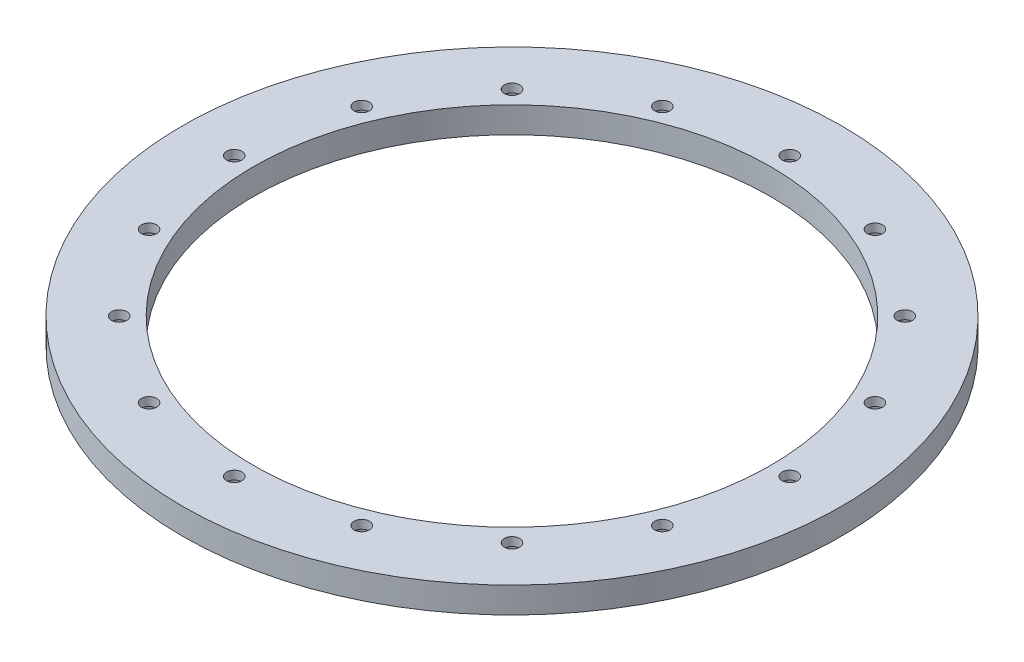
ISO-10303-21;
HEADER;
FILE_DESCRIPTION(('STEP AP214'),'2;1');
FILE_NAME('part.step','',(''),(''),'','','');
FILE_SCHEMA(('AUTOMOTIVE_DESIGN { 1 0 10303 214 1 1 1 1 }'));
ENDSEC;
DATA;
#1=APPLICATION_CONTEXT('core data for automotive mechanical design processes');
#2=APPLICATION_PROTOCOL_DEFINITION('international standard','automotive_design',2000,#1);
#3=PRODUCT_CONTEXT('',#1,'mechanical');
#4=PRODUCT('Part','Part','',(#3));
#5=PRODUCT_RELATED_PRODUCT_CATEGORY('part','',(#4));
#6=PRODUCT_DEFINITION_FORMATION('','',#4);
#7=PRODUCT_DEFINITION_CONTEXT('part definition',#1,'design');
#8=PRODUCT_DEFINITION('design','',#6,#7);
#9=PRODUCT_DEFINITION_SHAPE('','',#8);
#10=(LENGTH_UNIT() NAMED_UNIT(*) SI_UNIT(.MILLI.,.METRE.));
#11=(NAMED_UNIT(*) PLANE_ANGLE_UNIT() SI_UNIT($,.RADIAN.));
#12=(NAMED_UNIT(*) SI_UNIT($,.STERADIAN.) SOLID_ANGLE_UNIT());
#13=UNCERTAINTY_MEASURE_WITH_UNIT(LENGTH_MEASURE(1.E-05),#10,'distance_accuracy_value','');
#14=(GEOMETRIC_REPRESENTATION_CONTEXT(3) GLOBAL_UNCERTAINTY_ASSIGNED_CONTEXT((#13)) GLOBAL_UNIT_ASSIGNED_CONTEXT((#10,
#11,#12)) REPRESENTATION_CONTEXT('',''));
#15=CARTESIAN_POINT('',(0.,0.,0.));
#16=DIRECTION('',(0.,0.,1.));
#17=DIRECTION('',(1.,0.,0.));
#18=AXIS2_PLACEMENT_3D('',#15,#16,#17);
#19=CARTESIAN_POINT('',(0.,0.,0.));
#20=DIRECTION('',(0.,1.,0.));
#21=DIRECTION('',(0.,0.,1.));
#22=AXIS2_PLACEMENT_3D('',#19,#20,#21);
#23=PLANE('',#22);
#24=CARTESIAN_POINT('',(-94.2357123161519,0.,-39.0337101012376));
#25=DIRECTION('',(0.,-1.,0.));
#26=DIRECTION('',(0.,0.,-1.));
#27=AXIS2_PLACEMENT_3D('',#24,#25,#26);
#28=CIRCLE('',#27,4.96062);
#29=CARTESIAN_POINT('',(-94.2357123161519,0.,-43.9943301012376));
#30=VERTEX_POINT('',#29);
#31=EDGE_CURVE('E239',#30,#30,#28,.T.);
#32=ORIENTED_EDGE('',*,*,#31,.F.);
#33=EDGE_LOOP('',(#32));
#34=FACE_BOUND('',#33,.T.);
#35=CARTESIAN_POINT('',(-72.124891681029,0.,-72.1248916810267));
#36=DIRECTION('',(0.,-1.,0.));
#37=DIRECTION('',(0.,0.,-1.));
#38=AXIS2_PLACEMENT_3D('',#35,#36,#37);
#39=CIRCLE('',#38,4.96062);
#40=CARTESIAN_POINT('',(-72.124891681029,0.,-77.0855116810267));
#41=VERTEX_POINT('',#40);
#42=EDGE_CURVE('E227',#41,#41,#39,.T.);
#43=ORIENTED_EDGE('',*,*,#42,.F.);
#44=EDGE_LOOP('',(#43));
#45=FACE_BOUND('',#44,.T.);
#46=CARTESIAN_POINT('',(-1.424524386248E-12,0.,-102.));
#47=DIRECTION('',(0.,-1.,0.));
#48=DIRECTION('',(0.,0.,-1.));
#49=AXIS2_PLACEMENT_3D('',#46,#47,#48);
#50=CIRCLE('',#49,4.96062);
#51=CARTESIAN_POINT('',(-1.424524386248E-12,0.,-106.96062));
#52=VERTEX_POINT('',#51);
#53=EDGE_CURVE('E203',#52,#52,#50,.T.);
#54=ORIENTED_EDGE('',*,*,#53,.F.);
#55=EDGE_LOOP('',(#54));
#56=FACE_BOUND('',#55,.T.);
#57=CARTESIAN_POINT('',(39.0337101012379,0.,-94.2357123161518));
#58=DIRECTION('',(0.,-1.,0.));
#59=DIRECTION('',(0.,0.,-1.));
#60=AXIS2_PLACEMENT_3D('',#57,#58,#59);
#61=CIRCLE('',#60,4.96061999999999);
#62=CARTESIAN_POINT('',(39.0337101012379,0.,-99.1963323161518));
#63=VERTEX_POINT('',#62);
#64=EDGE_CURVE('E191',#63,#63,#61,.T.);
#65=ORIENTED_EDGE('',*,*,#64,.F.);
#66=EDGE_LOOP('',(#65));
#67=FACE_BOUND('',#66,.T.);
#68=CARTESIAN_POINT('',(72.124891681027,0.,-72.1248916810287));
#69=DIRECTION('',(0.,-1.,0.));
#70=DIRECTION('',(0.,0.,-1.));
#71=AXIS2_PLACEMENT_3D('',#68,#69,#70);
#72=CIRCLE('',#71,4.96062);
#73=CARTESIAN_POINT('',(72.124891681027,0.,-77.0855116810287));
#74=VERTEX_POINT('',#73);
#75=EDGE_CURVE('E179',#74,#74,#72,.T.);
#76=ORIENTED_EDGE('',*,*,#75,.F.);
#77=EDGE_LOOP('',(#76));
#78=FACE_BOUND('',#77,.T.);
#79=CARTESIAN_POINT('',(94.2357123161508,0.,-39.0337101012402));
#80=DIRECTION('',(0.,-1.,0.));
#81=DIRECTION('',(0.,0.,-1.));
#82=AXIS2_PLACEMENT_3D('',#79,#80,#81);
#83=CIRCLE('',#82,4.96062);
#84=CARTESIAN_POINT('',(94.2357123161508,0.,-43.9943301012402));
#85=VERTEX_POINT('',#84);
#86=EDGE_CURVE('E167',#85,#85,#83,.T.);
#87=ORIENTED_EDGE('',*,*,#86,.F.);
#88=EDGE_LOOP('',(#87));
#89=FACE_BOUND('',#88,.T.);
#90=CARTESIAN_POINT('',(94.2357123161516,0.,39.0337101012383));
#91=DIRECTION('',(0.,-1.,0.));
#92=DIRECTION('',(0.,0.,-1.));
#93=AXIS2_PLACEMENT_3D('',#90,#91,#92);
#94=CIRCLE('',#93,4.96062);
#95=CARTESIAN_POINT('',(94.2357123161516,0.,34.0730901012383));
#96=VERTEX_POINT('',#95);
#97=EDGE_CURVE('E143',#96,#96,#94,.T.);
#98=ORIENTED_EDGE('',*,*,#97,.F.);
#99=EDGE_LOOP('',(#98));
#100=FACE_BOUND('',#99,.T.);
#101=CARTESIAN_POINT('',(72.1248916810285,0.,72.1248916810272));
#102=DIRECTION('',(0.,-1.,0.));
#103=DIRECTION('',(0.,0.,-1.));
#104=AXIS2_PLACEMENT_3D('',#101,#102,#103);
#105=CIRCLE('',#104,4.96062);
#106=CARTESIAN_POINT('',(72.1248916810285,0.,67.1642716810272));
#107=VERTEX_POINT('',#106);
#108=EDGE_CURVE('E131',#107,#107,#105,.T.);
#109=ORIENTED_EDGE('',*,*,#108,.F.);
#110=EDGE_LOOP('',(#109));
#111=FACE_BOUND('',#110,.T.);
#112=CARTESIAN_POINT('',(39.0337101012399,0.,94.235712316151));
#113=DIRECTION('',(0.,-1.,0.));
#114=DIRECTION('',(0.,0.,-1.));
#115=AXIS2_PLACEMENT_3D('',#112,#113,#114);
#116=CIRCLE('',#115,4.96061999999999);
#117=CARTESIAN_POINT('',(39.0337101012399,0.,89.275092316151));
#118=VERTEX_POINT('',#117);
#119=EDGE_CURVE('E119',#118,#118,#116,.T.);
#120=ORIENTED_EDGE('',*,*,#119,.F.);
#121=EDGE_LOOP('',(#120));
#122=FACE_BOUND('',#121,.T.);
#123=CARTESIAN_POINT('',(7.12262193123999E-13,0.,102.));
#124=DIRECTION('',(0.,-1.,0.));
#125=DIRECTION('',(0.,0.,-1.));
#126=AXIS2_PLACEMENT_3D('',#123,#124,#125);
#127=CIRCLE('',#126,4.96062);
#128=CARTESIAN_POINT('',(7.12262193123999E-13,0.,97.03938));
#129=VERTEX_POINT('',#128);
#130=EDGE_CURVE('E107',#129,#129,#127,.T.);
#131=ORIENTED_EDGE('',*,*,#130,.F.);
#132=EDGE_LOOP('',(#131));
#133=FACE_BOUND('',#132,.T.);
#134=CARTESIAN_POINT('',(-39.0337101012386,0.,94.2357123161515));
#135=DIRECTION('',(0.,-1.,0.));
#136=DIRECTION('',(0.,0.,-1.));
#137=AXIS2_PLACEMENT_3D('',#134,#135,#136);
#138=CIRCLE('',#137,4.96061999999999);
#139=CARTESIAN_POINT('',(-39.0337101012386,0.,89.2750923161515));
#140=VERTEX_POINT('',#139);
#141=EDGE_CURVE('E95',#140,#140,#138,.T.);
#142=ORIENTED_EDGE('',*,*,#141,.F.);
#143=EDGE_LOOP('',(#142));
#144=FACE_BOUND('',#143,.T.);
#145=CARTESIAN_POINT('',(-72.1248916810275,0.,72.1248916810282));
#146=DIRECTION('',(0.,-1.,0.));
#147=DIRECTION('',(0.,0.,-1.));
#148=AXIS2_PLACEMENT_3D('',#145,#146,#147);
#149=CIRCLE('',#148,4.96062);
#150=CARTESIAN_POINT('',(-72.1248916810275,0.,67.1642716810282));
#151=VERTEX_POINT('',#150);
#152=EDGE_CURVE('E83',#151,#151,#149,.T.);
#153=ORIENTED_EDGE('',*,*,#152,.F.);
#154=EDGE_LOOP('',(#153));
#155=FACE_BOUND('',#154,.T.);
#156=CARTESIAN_POINT('',(-94.2357123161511,0.,39.0337101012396));
#157=DIRECTION('',(0.,-1.,0.));
#158=DIRECTION('',(0.,0.,-1.));
#159=AXIS2_PLACEMENT_3D('',#156,#157,#158);
#160=CIRCLE('',#159,4.96062);
#161=CARTESIAN_POINT('',(-94.2357123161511,0.,34.0730901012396));
#162=VERTEX_POINT('',#161);
#163=EDGE_CURVE('E71',#162,#162,#160,.T.);
#164=ORIENTED_EDGE('',*,*,#163,.F.);
#165=EDGE_LOOP('',(#164));
#166=FACE_BOUND('',#165,.T.);
#167=CARTESIAN_POINT('',(-102.,0.,3.56131096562E-13));
#168=DIRECTION('',(0.,-1.,0.));
#169=DIRECTION('',(0.,0.,-1.));
#170=AXIS2_PLACEMENT_3D('',#167,#168,#169);
#171=CIRCLE('',#170,4.96062);
#172=CARTESIAN_POINT('',(-102.,0.,-4.96061999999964));
#173=VERTEX_POINT('',#172);
#174=EDGE_CURVE('E59',#173,#173,#171,.T.);
#175=ORIENTED_EDGE('',*,*,#174,.F.);
#176=EDGE_LOOP('',(#175));
#177=FACE_BOUND('',#176,.T.);
#178=CARTESIAN_POINT('',(0.,0.,0.));
#179=DIRECTION('',(0.,1.,0.));
#180=DIRECTION('',(0.,0.,1.));
#181=AXIS2_PLACEMENT_3D('',#178,#179,#180);
#182=CIRCLE('',#181,121.016);
#183=CARTESIAN_POINT('',(0.,0.,-121.016));
#184=VERTEX_POINT('',#183);
#185=EDGE_CURVE('E36',#184,#184,#182,.T.);
#186=ORIENTED_EDGE('',*,*,#185,.F.);
#187=EDGE_LOOP('',(#186));
#188=FACE_BOUND('',#187,.T.);
#189=CARTESIAN_POINT('',(0.,0.,0.));
#190=DIRECTION('',(0.,1.,0.));
#191=DIRECTION('',(0.,0.,1.));
#192=AXIS2_PLACEMENT_3D('',#189,#190,#191);
#193=CIRCLE('',#192,95.);
#194=CARTESIAN_POINT('',(0.,0.,-95.));
#195=VERTEX_POINT('',#194);
#196=EDGE_CURVE('E45',#195,#195,#193,.T.);
#197=ORIENTED_EDGE('',*,*,#196,.T.);
#198=EDGE_LOOP('',(#197));
#199=FACE_BOUND('',#198,.T.);
#200=CARTESIAN_POINT('',(102.,0.,-3.56131096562E-13));
#201=DIRECTION('',(0.,-1.,0.));
#202=DIRECTION('',(0.,0.,-1.));
#203=AXIS2_PLACEMENT_3D('',#200,#201,#202);
#204=CIRCLE('',#203,4.96062);
#205=CARTESIAN_POINT('',(102.,0.,-4.96062000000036));
#206=VERTEX_POINT('',#205);
#207=EDGE_CURVE('E155',#206,#206,#204,.T.);
#208=ORIENTED_EDGE('',*,*,#207,.F.);
#209=EDGE_LOOP('',(#208));
#210=FACE_BOUND('',#209,.T.);
#211=CARTESIAN_POINT('',(-39.0337101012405,0.,-94.2357123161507));
#212=DIRECTION('',(0.,-1.,0.));
#213=DIRECTION('',(0.,0.,-1.));
#214=AXIS2_PLACEMENT_3D('',#211,#212,#213);
#215=CIRCLE('',#214,4.96061999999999);
#216=CARTESIAN_POINT('',(-39.0337101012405,0.,-99.1963323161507));
#217=VERTEX_POINT('',#216);
#218=EDGE_CURVE('E215',#217,#217,#215,.T.);
#219=ORIENTED_EDGE('',*,*,#218,.F.);
#220=EDGE_LOOP('',(#219));
#221=FACE_BOUND('',#220,.T.);
#222=ADVANCED_FACE('F32',(#34,#45,#56,#67,#78,#89,#100,#111,#122,#133,#144,#155,#166,#177,#188,
#199,#210,#221),#23,.F.);
#223=CARTESIAN_POINT('',(0.,9.525,0.));
#224=DIRECTION('',(0.,1.,0.));
#225=DIRECTION('',(0.,0.,1.));
#226=AXIS2_PLACEMENT_3D('',#223,#224,#225);
#227=PLANE('',#226);
#228=CARTESIAN_POINT('',(-94.2357123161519,9.525,-39.0337101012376));
#229=DIRECTION('',(0.,-1.,0.));
#230=DIRECTION('',(0.,0.,-1.));
#231=AXIS2_PLACEMENT_3D('',#228,#229,#230);
#232=CIRCLE('',#231,2.8067);
#233=CARTESIAN_POINT('',(-94.2357123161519,9.525,-41.8404101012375));
#234=VERTEX_POINT('',#233);
#235=EDGE_CURVE('E230',#234,#234,#232,.T.);
#236=ORIENTED_EDGE('',*,*,#235,.T.);
#237=EDGE_LOOP('',(#236));
#238=FACE_BOUND('',#237,.T.);
#239=CARTESIAN_POINT('',(-72.124891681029,9.525,-72.1248916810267));
#240=DIRECTION('',(0.,-1.,0.));
#241=DIRECTION('',(0.,0.,-1.));
#242=AXIS2_PLACEMENT_3D('',#239,#240,#241);
#243=CIRCLE('',#242,2.8067);
#244=CARTESIAN_POINT('',(-72.124891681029,9.525,-74.9315916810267));
#245=VERTEX_POINT('',#244);
#246=EDGE_CURVE('E218',#245,#245,#243,.T.);
#247=ORIENTED_EDGE('',*,*,#246,.T.);
#248=EDGE_LOOP('',(#247));
#249=FACE_BOUND('',#248,.T.);
#250=CARTESIAN_POINT('',(-39.0337101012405,9.525,-94.2357123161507));
#251=DIRECTION('',(0.,-1.,0.));
#252=DIRECTION('',(0.,0.,-1.));
#253=AXIS2_PLACEMENT_3D('',#250,#251,#252);
#254=CIRCLE('',#253,2.8067);
#255=CARTESIAN_POINT('',(-39.0337101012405,9.525,-97.0424123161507));
#256=VERTEX_POINT('',#255);
#257=EDGE_CURVE('E206',#256,#256,#254,.T.);
#258=ORIENTED_EDGE('',*,*,#257,.T.);
#259=EDGE_LOOP('',(#258));
#260=FACE_BOUND('',#259,.T.);
#261=CARTESIAN_POINT('',(-1.424524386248E-12,9.525,-102.));
#262=DIRECTION('',(0.,-1.,0.));
#263=DIRECTION('',(0.,0.,-1.));
#264=AXIS2_PLACEMENT_3D('',#261,#262,#263);
#265=CIRCLE('',#264,2.8067);
#266=CARTESIAN_POINT('',(-1.424524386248E-12,9.525,-104.8067));
#267=VERTEX_POINT('',#266);
#268=EDGE_CURVE('E194',#267,#267,#265,.T.);
#269=ORIENTED_EDGE('',*,*,#268,.T.);
#270=EDGE_LOOP('',(#269));
#271=FACE_BOUND('',#270,.T.);
#272=CARTESIAN_POINT('',(39.0337101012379,9.525,-94.2357123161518));
#273=DIRECTION('',(0.,-1.,0.));
#274=DIRECTION('',(0.,0.,-1.));
#275=AXIS2_PLACEMENT_3D('',#272,#273,#274);
#276=CIRCLE('',#275,2.8067);
#277=CARTESIAN_POINT('',(39.0337101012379,9.525,-97.0424123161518));
#278=VERTEX_POINT('',#277);
#279=EDGE_CURVE('E182',#278,#278,#276,.T.);
#280=ORIENTED_EDGE('',*,*,#279,.T.);
#281=EDGE_LOOP('',(#280));
#282=FACE_BOUND('',#281,.T.);
#283=CARTESIAN_POINT('',(72.124891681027,9.525,-72.1248916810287));
#284=DIRECTION('',(0.,-1.,0.));
#285=DIRECTION('',(0.,0.,-1.));
#286=AXIS2_PLACEMENT_3D('',#283,#284,#285);
#287=CIRCLE('',#286,2.8067);
#288=CARTESIAN_POINT('',(72.124891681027,9.525,-74.9315916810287));
#289=VERTEX_POINT('',#288);
#290=EDGE_CURVE('E170',#289,#289,#287,.T.);
#291=ORIENTED_EDGE('',*,*,#290,.T.);
#292=EDGE_LOOP('',(#291));
#293=FACE_BOUND('',#292,.T.);
#294=CARTESIAN_POINT('',(94.2357123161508,9.525,-39.0337101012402));
#295=DIRECTION('',(0.,-1.,0.));
#296=DIRECTION('',(0.,0.,-1.));
#297=AXIS2_PLACEMENT_3D('',#294,#295,#296);
#298=CIRCLE('',#297,2.8067);
#299=CARTESIAN_POINT('',(94.2357123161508,9.525,-41.8404101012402));
#300=VERTEX_POINT('',#299);
#301=EDGE_CURVE('E158',#300,#300,#298,.T.);
#302=ORIENTED_EDGE('',*,*,#301,.T.);
#303=EDGE_LOOP('',(#302));
#304=FACE_BOUND('',#303,.T.);
#305=CARTESIAN_POINT('',(0.,9.525,0.));
#306=DIRECTION('',(0.,1.,0.));
#307=DIRECTION('',(0.,0.,1.));
#308=AXIS2_PLACEMENT_3D('',#305,#306,#307);
#309=CIRCLE('',#308,95.);
#310=CARTESIAN_POINT('',(0.,9.525,-95.));
#311=VERTEX_POINT('',#310);
#312=EDGE_CURVE('E43',#311,#311,#309,.T.);
#313=ORIENTED_EDGE('',*,*,#312,.F.);
#314=EDGE_LOOP('',(#313));
#315=FACE_BOUND('',#314,.T.);
#316=CARTESIAN_POINT('',(0.,9.525,0.));
#317=DIRECTION('',(0.,1.,0.));
#318=DIRECTION('',(0.,0.,1.));
#319=AXIS2_PLACEMENT_3D('',#316,#317,#318);
#320=CIRCLE('',#319,121.016);
#321=CARTESIAN_POINT('',(0.,9.525,-121.016));
#322=VERTEX_POINT('',#321);
#323=EDGE_CURVE('E10',#322,#322,#320,.T.);
#324=ORIENTED_EDGE('',*,*,#323,.T.);
#325=EDGE_LOOP('',(#324));
#326=FACE_BOUND('',#325,.T.);
#327=CARTESIAN_POINT('',(-102.,9.525,3.56131096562E-13));
#328=DIRECTION('',(0.,-1.,0.));
#329=DIRECTION('',(0.,0.,-1.));
#330=AXIS2_PLACEMENT_3D('',#327,#328,#329);
#331=CIRCLE('',#330,2.8067);
#332=CARTESIAN_POINT('',(-102.,9.525,-2.80669999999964));
#333=VERTEX_POINT('',#332);
#334=EDGE_CURVE('E48',#333,#333,#331,.T.);
#335=ORIENTED_EDGE('',*,*,#334,.T.);
#336=EDGE_LOOP('',(#335));
#337=FACE_BOUND('',#336,.T.);
#338=CARTESIAN_POINT('',(-94.2357123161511,9.525,39.0337101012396));
#339=DIRECTION('',(0.,-1.,0.));
#340=DIRECTION('',(0.,0.,-1.));
#341=AXIS2_PLACEMENT_3D('',#338,#339,#340);
#342=CIRCLE('',#341,2.8067);
#343=CARTESIAN_POINT('',(-94.2357123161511,9.525,36.2270101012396));
#344=VERTEX_POINT('',#343);
#345=EDGE_CURVE('E62',#344,#344,#342,.T.);
#346=ORIENTED_EDGE('',*,*,#345,.T.);
#347=EDGE_LOOP('',(#346));
#348=FACE_BOUND('',#347,.T.);
#349=CARTESIAN_POINT('',(-72.1248916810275,9.525,72.1248916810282));
#350=DIRECTION('',(0.,-1.,0.));
#351=DIRECTION('',(0.,0.,-1.));
#352=AXIS2_PLACEMENT_3D('',#349,#350,#351);
#353=CIRCLE('',#352,2.8067);
#354=CARTESIAN_POINT('',(-72.1248916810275,9.525,69.3181916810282));
#355=VERTEX_POINT('',#354);
#356=EDGE_CURVE('E74',#355,#355,#353,.T.);
#357=ORIENTED_EDGE('',*,*,#356,.T.);
#358=EDGE_LOOP('',(#357));
#359=FACE_BOUND('',#358,.T.);
#360=CARTESIAN_POINT('',(-39.0337101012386,9.525,94.2357123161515));
#361=DIRECTION('',(0.,-1.,0.));
#362=DIRECTION('',(0.,0.,-1.));
#363=AXIS2_PLACEMENT_3D('',#360,#361,#362);
#364=CIRCLE('',#363,2.8067);
#365=CARTESIAN_POINT('',(-39.0337101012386,9.525,91.4290123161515));
#366=VERTEX_POINT('',#365);
#367=EDGE_CURVE('E86',#366,#366,#364,.T.);
#368=ORIENTED_EDGE('',*,*,#367,.T.);
#369=EDGE_LOOP('',(#368));
#370=FACE_BOUND('',#369,.T.);
#371=CARTESIAN_POINT('',(7.12262193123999E-13,9.525,102.));
#372=DIRECTION('',(0.,-1.,0.));
#373=DIRECTION('',(0.,0.,-1.));
#374=AXIS2_PLACEMENT_3D('',#371,#372,#373);
#375=CIRCLE('',#374,2.8067);
#376=CARTESIAN_POINT('',(7.12262193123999E-13,9.525,99.1933));
#377=VERTEX_POINT('',#376);
#378=EDGE_CURVE('E98',#377,#377,#375,.T.);
#379=ORIENTED_EDGE('',*,*,#378,.T.);
#380=EDGE_LOOP('',(#379));
#381=FACE_BOUND('',#380,.T.);
#382=CARTESIAN_POINT('',(39.0337101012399,9.525,94.235712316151));
#383=DIRECTION('',(0.,-1.,0.));
#384=DIRECTION('',(0.,0.,-1.));
#385=AXIS2_PLACEMENT_3D('',#382,#383,#384);
#386=CIRCLE('',#385,2.8067);
#387=CARTESIAN_POINT('',(39.0337101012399,9.525,91.429012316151));
#388=VERTEX_POINT('',#387);
#389=EDGE_CURVE('E110',#388,#388,#386,.T.);
#390=ORIENTED_EDGE('',*,*,#389,.T.);
#391=EDGE_LOOP('',(#390));
#392=FACE_BOUND('',#391,.T.);
#393=CARTESIAN_POINT('',(72.1248916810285,9.525,72.1248916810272));
#394=DIRECTION('',(0.,-1.,0.));
#395=DIRECTION('',(0.,0.,-1.));
#396=AXIS2_PLACEMENT_3D('',#393,#394,#395);
#397=CIRCLE('',#396,2.8067);
#398=CARTESIAN_POINT('',(72.1248916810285,9.525,69.3181916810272));
#399=VERTEX_POINT('',#398);
#400=EDGE_CURVE('E122',#399,#399,#397,.T.);
#401=ORIENTED_EDGE('',*,*,#400,.T.);
#402=EDGE_LOOP('',(#401));
#403=FACE_BOUND('',#402,.T.);
#404=CARTESIAN_POINT('',(94.2357123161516,9.525,39.0337101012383));
#405=DIRECTION('',(0.,-1.,0.));
#406=DIRECTION('',(0.,0.,-1.));
#407=AXIS2_PLACEMENT_3D('',#404,#405,#406);
#408=CIRCLE('',#407,2.8067);
#409=CARTESIAN_POINT('',(94.2357123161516,9.525,36.2270101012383));
#410=VERTEX_POINT('',#409);
#411=EDGE_CURVE('E134',#410,#410,#408,.T.);
#412=ORIENTED_EDGE('',*,*,#411,.T.);
#413=EDGE_LOOP('',(#412));
#414=FACE_BOUND('',#413,.T.);
#415=CARTESIAN_POINT('',(102.,9.525,-3.56131096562E-13));
#416=DIRECTION('',(0.,-1.,0.));
#417=DIRECTION('',(0.,0.,-1.));
#418=AXIS2_PLACEMENT_3D('',#415,#416,#417);
#419=CIRCLE('',#418,2.8067);
#420=CARTESIAN_POINT('',(102.,9.525,-2.80670000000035));
#421=VERTEX_POINT('',#420);
#422=EDGE_CURVE('E146',#421,#421,#419,.T.);
#423=ORIENTED_EDGE('',*,*,#422,.T.);
#424=EDGE_LOOP('',(#423));
#425=FACE_BOUND('',#424,.T.);
#426=ADVANCED_FACE('F247',(#238,#249,#260,#271,#282,#293,#304,#315,#326,#337,#348,#359,#370,
#381,#392,#403,#414,#425),#227,.T.);
#427=CARTESIAN_POINT('',(0.,9.525,0.));
#428=DIRECTION('',(0.,-1.,0.));
#429=DIRECTION('',(0.,0.,-1.));
#430=AXIS2_PLACEMENT_3D('',#427,#428,#429);
#431=CYLINDRICAL_SURFACE('',#430,121.016);
#432=CARTESIAN_POINT('',(0.,9.525,-121.016));
#433=CARTESIAN_POINT('',(0.,9.42578125,-121.016));
#434=CARTESIAN_POINT('',(0.,9.3265625,-121.016));
#435=CARTESIAN_POINT('',(0.,9.128125,-121.016));
#436=CARTESIAN_POINT('',(0.,9.02890625,-121.016));
#437=CARTESIAN_POINT('',(0.,8.83046875,-121.016));
#438=CARTESIAN_POINT('',(0.,8.73125,-121.016));
#439=CARTESIAN_POINT('',(0.,8.5328125,-121.016));
#440=CARTESIAN_POINT('',(0.,8.43359375,-121.016));
#441=CARTESIAN_POINT('',(0.,8.23515625,-121.016));
#442=CARTESIAN_POINT('',(0.,8.1359375,-121.016));
#443=CARTESIAN_POINT('',(0.,7.9375,-121.016));
#444=CARTESIAN_POINT('',(0.,7.83828125,-121.016));
#445=CARTESIAN_POINT('',(0.,7.63984375,-121.016));
#446=CARTESIAN_POINT('',(0.,7.540625,-121.016));
#447=CARTESIAN_POINT('',(0.,7.3421875,-121.016));
#448=CARTESIAN_POINT('',(0.,7.24296875,-121.016));
#449=CARTESIAN_POINT('',(0.,7.04453125,-121.016));
#450=CARTESIAN_POINT('',(0.,6.9453125,-121.016));
#451=CARTESIAN_POINT('',(0.,6.746875,-121.016));
#452=CARTESIAN_POINT('',(0.,6.64765625,-121.016));
#453=CARTESIAN_POINT('',(0.,6.44921875,-121.016));
#454=CARTESIAN_POINT('',(0.,6.35,-121.016));
#455=CARTESIAN_POINT('',(0.,6.1515625,-121.016));
#456=CARTESIAN_POINT('',(0.,6.05234375,-121.016));
#457=CARTESIAN_POINT('',(0.,5.85390625,-121.016));
#458=CARTESIAN_POINT('',(0.,5.7546875,-121.016));
#459=CARTESIAN_POINT('',(0.,5.55625,-121.016));
#460=CARTESIAN_POINT('',(0.,5.45703125,-121.016));
#461=CARTESIAN_POINT('',(0.,5.25859375,-121.016));
#462=CARTESIAN_POINT('',(0.,5.159375,-121.016));
#463=CARTESIAN_POINT('',(0.,4.9609375,-121.016));
#464=CARTESIAN_POINT('',(0.,4.86171875,-121.016));
#465=CARTESIAN_POINT('',(0.,4.66328125,-121.016));
#466=CARTESIAN_POINT('',(0.,4.5640625,-121.016));
#467=CARTESIAN_POINT('',(0.,4.365625,-121.016));
#468=CARTESIAN_POINT('',(0.,4.26640625,-121.016));
#469=CARTESIAN_POINT('',(0.,4.06796875,-121.016));
#470=CARTESIAN_POINT('',(0.,3.96875,-121.016));
#471=CARTESIAN_POINT('',(0.,3.7703125,-121.016));
#472=CARTESIAN_POINT('',(0.,3.67109375,-121.016));
#473=CARTESIAN_POINT('',(0.,3.47265625,-121.016));
#474=CARTESIAN_POINT('',(0.,3.3734375,-121.016));
#475=CARTESIAN_POINT('',(0.,3.175,-121.016));
#476=CARTESIAN_POINT('',(0.,3.07578125,-121.016));
#477=CARTESIAN_POINT('',(0.,2.87734375,-121.016));
#478=CARTESIAN_POINT('',(0.,2.778125,-121.016));
#479=CARTESIAN_POINT('',(0.,2.5796875,-121.016));
#480=CARTESIAN_POINT('',(0.,2.48046875,-121.016));
#481=CARTESIAN_POINT('',(0.,2.28203125,-121.016));
#482=CARTESIAN_POINT('',(0.,2.1828125,-121.016));
#483=CARTESIAN_POINT('',(0.,1.984375,-121.016));
#484=CARTESIAN_POINT('',(0.,1.88515625,-121.016));
#485=CARTESIAN_POINT('',(0.,1.68671875,-121.016));
#486=CARTESIAN_POINT('',(0.,1.5875,-121.016));
#487=CARTESIAN_POINT('',(0.,1.3890625,-121.016));
#488=CARTESIAN_POINT('',(0.,1.28984375,-121.016));
#489=CARTESIAN_POINT('',(0.,1.09140625,-121.016));
#490=CARTESIAN_POINT('',(0.,0.992187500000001,-121.016));
#491=CARTESIAN_POINT('',(0.,0.793750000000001,-121.016));
#492=CARTESIAN_POINT('',(0.,0.69453125,-121.016));
#493=CARTESIAN_POINT('',(0.,0.49609375,-121.016));
#494=CARTESIAN_POINT('',(0.,0.396875,-121.016));
#495=CARTESIAN_POINT('',(0.,0.1984375,-121.016));
#496=CARTESIAN_POINT('',(0.,0.0992187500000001,-121.016));
#497=CARTESIAN_POINT('',(0.,0.,-121.016));
#498=B_SPLINE_CURVE_WITH_KNOTS('',3,(#432,#433,#434,#435,#436,#437,#438,#439,#440,#441,#442,
#443,#444,#445,#446,#447,#448,#449,#450,#451,#452,#453,#454,#455,#456,#457,#458,#459,#460,#461,
#462,#463,#464,#465,#466,#467,#468,#469,#470,#471,#472,#473,#474,#475,#476,#477,#478,#479,#480,
#481,#482,#483,#484,#485,#486,#487,#488,#489,#490,#491,#492,#493,#494,#495,#496,#497),
.UNSPECIFIED.,.F.,.F.,(4,2,2,2,2,2,2,2,2,2,2,2,2,2,2,2,2,2,2,2,2,2,2,2,2,2,2,2,2,2,2,2,4),(0.,
0.297656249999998,0.595312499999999,0.892968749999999,1.190625,1.48828125,1.7859375,2.08359375,
2.38125,2.67890625,2.9765625,3.27421875,3.571875,3.86953125,4.1671875,4.46484375,4.7625,
5.06015625,5.3578125,5.65546875,5.953125,6.25078125,6.5484375,6.84609375,7.14375,7.44140625,
7.7390625,8.03671875,8.334375,8.63203125,8.9296875,9.22734375,9.525),.UNSPECIFIED.);
#499=EDGE_CURVE('BSEAM34',#322,#184,#498,.T.);
#500=ORIENTED_EDGE('',*,*,#323,.F.);
#501=ORIENTED_EDGE('',*,*,#185,.T.);
#502=ORIENTED_EDGE('',*,*,#499,.T.);
#503=ORIENTED_EDGE('',*,*,#499,.F.);
#504=EDGE_LOOP('',(#500,#502,#501,#503));
#505=FACE_BOUND('',#504,.T.);
#506=ADVANCED_FACE('F34',(#505),#431,.T.);
#507=CARTESIAN_POINT('',(0.,9.525,0.));
#508=DIRECTION('',(0.,-1.,0.));
#509=DIRECTION('',(0.,0.,-1.));
#510=AXIS2_PLACEMENT_3D('',#507,#508,#509);
#511=CYLINDRICAL_SURFACE('',#510,95.);
#512=CARTESIAN_POINT('',(0.,9.525,-95.));
#513=CARTESIAN_POINT('',(0.,9.42578125,-95.));
#514=CARTESIAN_POINT('',(0.,9.3265625,-95.));
#515=CARTESIAN_POINT('',(0.,9.128125,-95.));
#516=CARTESIAN_POINT('',(0.,9.02890625,-95.));
#517=CARTESIAN_POINT('',(0.,8.83046875,-95.));
#518=CARTESIAN_POINT('',(0.,8.73125,-95.));
#519=CARTESIAN_POINT('',(0.,8.5328125,-95.));
#520=CARTESIAN_POINT('',(0.,8.43359375,-95.));
#521=CARTESIAN_POINT('',(0.,8.23515625,-95.));
#522=CARTESIAN_POINT('',(0.,8.1359375,-95.));
#523=CARTESIAN_POINT('',(0.,7.9375,-95.));
#524=CARTESIAN_POINT('',(0.,7.83828125,-95.));
#525=CARTESIAN_POINT('',(0.,7.63984375,-95.));
#526=CARTESIAN_POINT('',(0.,7.540625,-95.));
#527=CARTESIAN_POINT('',(0.,7.3421875,-95.));
#528=CARTESIAN_POINT('',(0.,7.24296875,-95.));
#529=CARTESIAN_POINT('',(0.,7.04453125,-95.));
#530=CARTESIAN_POINT('',(0.,6.9453125,-95.));
#531=CARTESIAN_POINT('',(0.,6.746875,-95.));
#532=CARTESIAN_POINT('',(0.,6.64765625,-95.));
#533=CARTESIAN_POINT('',(0.,6.44921875,-95.));
#534=CARTESIAN_POINT('',(0.,6.35,-95.));
#535=CARTESIAN_POINT('',(0.,6.1515625,-95.));
#536=CARTESIAN_POINT('',(0.,6.05234375,-95.));
#537=CARTESIAN_POINT('',(0.,5.85390625,-95.));
#538=CARTESIAN_POINT('',(0.,5.7546875,-95.));
#539=CARTESIAN_POINT('',(0.,5.55625,-95.));
#540=CARTESIAN_POINT('',(0.,5.45703125,-95.));
#541=CARTESIAN_POINT('',(0.,5.25859375,-95.));
#542=CARTESIAN_POINT('',(0.,5.159375,-95.));
#543=CARTESIAN_POINT('',(0.,4.9609375,-95.));
#544=CARTESIAN_POINT('',(0.,4.86171875,-95.));
#545=CARTESIAN_POINT('',(0.,4.66328125,-95.));
#546=CARTESIAN_POINT('',(0.,4.5640625,-95.));
#547=CARTESIAN_POINT('',(0.,4.365625,-95.));
#548=CARTESIAN_POINT('',(0.,4.26640625,-95.));
#549=CARTESIAN_POINT('',(0.,4.06796875,-95.));
#550=CARTESIAN_POINT('',(0.,3.96875,-95.));
#551=CARTESIAN_POINT('',(0.,3.7703125,-95.));
#552=CARTESIAN_POINT('',(0.,3.67109375,-95.));
#553=CARTESIAN_POINT('',(0.,3.47265625,-95.));
#554=CARTESIAN_POINT('',(0.,3.3734375,-95.));
#555=CARTESIAN_POINT('',(0.,3.175,-95.));
#556=CARTESIAN_POINT('',(0.,3.07578125,-95.));
#557=CARTESIAN_POINT('',(0.,2.87734375,-95.));
#558=CARTESIAN_POINT('',(0.,2.778125,-95.));
#559=CARTESIAN_POINT('',(0.,2.5796875,-95.));
#560=CARTESIAN_POINT('',(0.,2.48046875,-95.));
#561=CARTESIAN_POINT('',(0.,2.28203125,-95.));
#562=CARTESIAN_POINT('',(0.,2.1828125,-95.));
#563=CARTESIAN_POINT('',(0.,1.984375,-95.));
#564=CARTESIAN_POINT('',(0.,1.88515625,-95.));
#565=CARTESIAN_POINT('',(0.,1.68671875,-95.));
#566=CARTESIAN_POINT('',(0.,1.5875,-95.));
#567=CARTESIAN_POINT('',(0.,1.3890625,-95.));
#568=CARTESIAN_POINT('',(0.,1.28984375,-95.));
#569=CARTESIAN_POINT('',(0.,1.09140625,-95.));
#570=CARTESIAN_POINT('',(0.,0.992187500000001,-95.));
#571=CARTESIAN_POINT('',(0.,0.793750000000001,-95.));
#572=CARTESIAN_POINT('',(0.,0.69453125,-95.));
#573=CARTESIAN_POINT('',(0.,0.49609375,-95.));
#574=CARTESIAN_POINT('',(0.,0.396875,-95.));
#575=CARTESIAN_POINT('',(0.,0.1984375,-95.));
#576=CARTESIAN_POINT('',(0.,0.0992187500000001,-95.));
#577=CARTESIAN_POINT('',(0.,0.,-95.));
#578=B_SPLINE_CURVE_WITH_KNOTS('',3,(#512,#513,#514,#515,#516,#517,#518,#519,#520,#521,#522,
#523,#524,#525,#526,#527,#528,#529,#530,#531,#532,#533,#534,#535,#536,#537,#538,#539,#540,#541,
#542,#543,#544,#545,#546,#547,#548,#549,#550,#551,#552,#553,#554,#555,#556,#557,#558,#559,#560,
#561,#562,#563,#564,#565,#566,#567,#568,#569,#570,#571,#572,#573,#574,#575,#576,#577),
.UNSPECIFIED.,.F.,.F.,(4,2,2,2,2,2,2,2,2,2,2,2,2,2,2,2,2,2,2,2,2,2,2,2,2,2,2,2,2,2,2,2,4),(0.,
0.297656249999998,0.595312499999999,0.892968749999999,1.190625,1.48828125,1.7859375,2.08359375,
2.38125,2.67890625,2.9765625,3.27421875,3.571875,3.86953125,4.1671875,4.46484375,4.7625,
5.06015625,5.3578125,5.65546875,5.953125,6.25078125,6.5484375,6.84609375,7.14375,7.44140625,
7.7390625,8.03671875,8.334375,8.63203125,8.9296875,9.22734375,9.525),.UNSPECIFIED.);
#579=EDGE_CURVE('BSEAM459',#311,#195,#578,.T.);
#580=ORIENTED_EDGE('',*,*,#312,.T.);
#581=ORIENTED_EDGE('',*,*,#196,.F.);
#582=ORIENTED_EDGE('',*,*,#579,.T.);
#583=ORIENTED_EDGE('',*,*,#579,.F.);
#584=EDGE_LOOP('',(#580,#582,#581,#583));
#585=FACE_BOUND('',#584,.T.);
#586=ADVANCED_FACE('F459',(#585),#511,.F.);
#587=CARTESIAN_POINT('',(-102.,0.,3.56131096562E-13));
#588=DIRECTION('',(0.,-1.,0.));
#589=DIRECTION('',(0.,0.,-1.));
#590=AXIS2_PLACEMENT_3D('',#587,#588,#589);
#591=CYLINDRICAL_SURFACE('',#590,2.8067);
#592=ORIENTED_EDGE('',*,*,#334,.F.);
#593=EDGE_LOOP('',(#592));
#594=FACE_BOUND('',#593,.T.);
#595=CARTESIAN_POINT('',(-102.,6.3754,3.56131096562E-13));
#596=DIRECTION('',(0.,-1.,0.));
#597=DIRECTION('',(0.,0.,-1.));
#598=AXIS2_PLACEMENT_3D('',#595,#596,#597);
#599=CIRCLE('',#598,2.8067);
#600=CARTESIAN_POINT('',(-102.,6.3754,-2.80669999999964));
#601=VERTEX_POINT('',#600);
#602=EDGE_CURVE('E53',#601,#601,#599,.T.);
#603=ORIENTED_EDGE('',*,*,#602,.T.);
#604=EDGE_LOOP('',(#603));
#605=FACE_BOUND('',#604,.T.);
#606=ADVANCED_FACE('F455',(#594,#605),#591,.F.);
#607=CARTESIAN_POINT('',(-99.1933,6.3754,3.56131096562E-13));
#608=DIRECTION('',(0.,1.,0.));
#609=DIRECTION('',(0.,0.,1.));
#610=AXIS2_PLACEMENT_3D('',#607,#608,#609);
#611=PLANE('',#610);
#612=ORIENTED_EDGE('',*,*,#602,.F.);
#613=EDGE_LOOP('',(#612));
#614=FACE_BOUND('',#613,.T.);
#615=CARTESIAN_POINT('',(-102.,6.3754,3.56131096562E-13));
#616=DIRECTION('',(0.,-1.,0.));
#617=DIRECTION('',(0.,0.,-1.));
#618=AXIS2_PLACEMENT_3D('',#615,#616,#617);
#619=CIRCLE('',#618,4.96062);
#620=CARTESIAN_POINT('',(-102.,6.3754,-4.96061999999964));
#621=VERTEX_POINT('',#620);
#622=EDGE_CURVE('E56',#621,#621,#619,.T.);
#623=ORIENTED_EDGE('',*,*,#622,.T.);
#624=EDGE_LOOP('',(#623));
#625=FACE_BOUND('',#624,.T.);
#626=ADVANCED_FACE('F451',(#614,#625),#611,.F.);
#627=CARTESIAN_POINT('',(-102.,0.,3.56131096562E-13));
#628=DIRECTION('',(0.,-1.,0.));
#629=DIRECTION('',(0.,0.,-1.));
#630=AXIS2_PLACEMENT_3D('',#627,#628,#629);
#631=CYLINDRICAL_SURFACE('',#630,4.96062);
#632=ORIENTED_EDGE('',*,*,#622,.F.);
#633=EDGE_LOOP('',(#632));
#634=FACE_BOUND('',#633,.T.);
#635=ORIENTED_EDGE('',*,*,#174,.T.);
#636=EDGE_LOOP('',(#635));
#637=FACE_BOUND('',#636,.T.);
#638=ADVANCED_FACE('F447',(#634,#637),#631,.F.);
#639=CARTESIAN_POINT('',(-94.2357123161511,0.,39.0337101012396));
#640=DIRECTION('',(0.,-1.,0.));
#641=DIRECTION('',(0.,0.,-1.));
#642=AXIS2_PLACEMENT_3D('',#639,#640,#641);
#643=CYLINDRICAL_SURFACE('',#642,2.8067);
#644=ORIENTED_EDGE('',*,*,#345,.F.);
#645=EDGE_LOOP('',(#644));
#646=FACE_BOUND('',#645,.T.);
#647=CARTESIAN_POINT('',(-94.2357123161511,6.3754,39.0337101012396));
#648=DIRECTION('',(0.,-1.,0.));
#649=DIRECTION('',(0.,0.,-1.));
#650=AXIS2_PLACEMENT_3D('',#647,#648,#649);
#651=CIRCLE('',#650,2.8067);
#652=CARTESIAN_POINT('',(-94.2357123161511,6.3754,36.2270101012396));
#653=VERTEX_POINT('',#652);
#654=EDGE_CURVE('E65',#653,#653,#651,.T.);
#655=ORIENTED_EDGE('',*,*,#654,.T.);
#656=EDGE_LOOP('',(#655));
#657=FACE_BOUND('',#656,.T.);
#658=ADVANCED_FACE('F443',(#646,#657),#643,.F.);
#659=CARTESIAN_POINT('',(-91.4290123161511,6.3754,39.0337101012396));
#660=DIRECTION('',(0.,1.,0.));
#661=DIRECTION('',(0.,0.,1.));
#662=AXIS2_PLACEMENT_3D('',#659,#660,#661);
#663=PLANE('',#662);
#664=ORIENTED_EDGE('',*,*,#654,.F.);
#665=EDGE_LOOP('',(#664));
#666=FACE_BOUND('',#665,.T.);
#667=CARTESIAN_POINT('',(-94.2357123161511,6.3754,39.0337101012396));
#668=DIRECTION('',(0.,-1.,0.));
#669=DIRECTION('',(0.,0.,-1.));
#670=AXIS2_PLACEMENT_3D('',#667,#668,#669);
#671=CIRCLE('',#670,4.96062);
#672=CARTESIAN_POINT('',(-94.2357123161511,6.3754,34.0730901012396));
#673=VERTEX_POINT('',#672);
#674=EDGE_CURVE('E68',#673,#673,#671,.T.);
#675=ORIENTED_EDGE('',*,*,#674,.T.);
#676=EDGE_LOOP('',(#675));
#677=FACE_BOUND('',#676,.T.);
#678=ADVANCED_FACE('F439',(#666,#677),#663,.F.);
#679=CARTESIAN_POINT('',(-94.2357123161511,0.,39.0337101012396));
#680=DIRECTION('',(0.,-1.,0.));
#681=DIRECTION('',(0.,0.,-1.));
#682=AXIS2_PLACEMENT_3D('',#679,#680,#681);
#683=CYLINDRICAL_SURFACE('',#682,4.96062);
#684=ORIENTED_EDGE('',*,*,#674,.F.);
#685=EDGE_LOOP('',(#684));
#686=FACE_BOUND('',#685,.T.);
#687=ORIENTED_EDGE('',*,*,#163,.T.);
#688=EDGE_LOOP('',(#687));
#689=FACE_BOUND('',#688,.T.);
#690=ADVANCED_FACE('F435',(#686,#689),#683,.F.);
#691=CARTESIAN_POINT('',(-72.1248916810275,0.,72.1248916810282));
#692=DIRECTION('',(0.,-1.,0.));
#693=DIRECTION('',(0.,0.,-1.));
#694=AXIS2_PLACEMENT_3D('',#691,#692,#693);
#695=CYLINDRICAL_SURFACE('',#694,2.8067);
#696=ORIENTED_EDGE('',*,*,#356,.F.);
#697=EDGE_LOOP('',(#696));
#698=FACE_BOUND('',#697,.T.);
#699=CARTESIAN_POINT('',(-72.1248916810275,6.3754,72.1248916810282));
#700=DIRECTION('',(0.,-1.,0.));
#701=DIRECTION('',(0.,0.,-1.));
#702=AXIS2_PLACEMENT_3D('',#699,#700,#701);
#703=CIRCLE('',#702,2.8067);
#704=CARTESIAN_POINT('',(-72.1248916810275,6.3754,69.3181916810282));
#705=VERTEX_POINT('',#704);
#706=EDGE_CURVE('E77',#705,#705,#703,.T.);
#707=ORIENTED_EDGE('',*,*,#706,.T.);
#708=EDGE_LOOP('',(#707));
#709=FACE_BOUND('',#708,.T.);
#710=ADVANCED_FACE('F431',(#698,#709),#695,.F.);
#711=CARTESIAN_POINT('',(-69.3181916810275,6.3754,72.1248916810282));
#712=DIRECTION('',(0.,1.,0.));
#713=DIRECTION('',(0.,0.,1.));
#714=AXIS2_PLACEMENT_3D('',#711,#712,#713);
#715=PLANE('',#714);
#716=ORIENTED_EDGE('',*,*,#706,.F.);
#717=EDGE_LOOP('',(#716));
#718=FACE_BOUND('',#717,.T.);
#719=CARTESIAN_POINT('',(-72.1248916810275,6.3754,72.1248916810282));
#720=DIRECTION('',(0.,-1.,0.));
#721=DIRECTION('',(0.,0.,-1.));
#722=AXIS2_PLACEMENT_3D('',#719,#720,#721);
#723=CIRCLE('',#722,4.96062);
#724=CARTESIAN_POINT('',(-72.1248916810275,6.3754,67.1642716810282));
#725=VERTEX_POINT('',#724);
#726=EDGE_CURVE('E80',#725,#725,#723,.T.);
#727=ORIENTED_EDGE('',*,*,#726,.T.);
#728=EDGE_LOOP('',(#727));
#729=FACE_BOUND('',#728,.T.);
#730=ADVANCED_FACE('F427',(#718,#729),#715,.F.);
#731=CARTESIAN_POINT('',(-72.1248916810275,0.,72.1248916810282));
#732=DIRECTION('',(0.,-1.,0.));
#733=DIRECTION('',(0.,0.,-1.));
#734=AXIS2_PLACEMENT_3D('',#731,#732,#733);
#735=CYLINDRICAL_SURFACE('',#734,4.96062);
#736=ORIENTED_EDGE('',*,*,#726,.F.);
#737=EDGE_LOOP('',(#736));
#738=FACE_BOUND('',#737,.T.);
#739=ORIENTED_EDGE('',*,*,#152,.T.);
#740=EDGE_LOOP('',(#739));
#741=FACE_BOUND('',#740,.T.);
#742=ADVANCED_FACE('F423',(#738,#741),#735,.F.);
#743=CARTESIAN_POINT('',(-39.0337101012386,0.,94.2357123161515));
#744=DIRECTION('',(0.,-1.,0.));
#745=DIRECTION('',(0.,0.,-1.));
#746=AXIS2_PLACEMENT_3D('',#743,#744,#745);
#747=CYLINDRICAL_SURFACE('',#746,2.8067);
#748=ORIENTED_EDGE('',*,*,#367,.F.);
#749=EDGE_LOOP('',(#748));
#750=FACE_BOUND('',#749,.T.);
#751=CARTESIAN_POINT('',(-39.0337101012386,6.3754,94.2357123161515));
#752=DIRECTION('',(0.,-1.,0.));
#753=DIRECTION('',(0.,0.,-1.));
#754=AXIS2_PLACEMENT_3D('',#751,#752,#753);
#755=CIRCLE('',#754,2.8067);
#756=CARTESIAN_POINT('',(-39.0337101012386,6.3754,91.4290123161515));
#757=VERTEX_POINT('',#756);
#758=EDGE_CURVE('E89',#757,#757,#755,.T.);
#759=ORIENTED_EDGE('',*,*,#758,.T.);
#760=EDGE_LOOP('',(#759));
#761=FACE_BOUND('',#760,.T.);
#762=ADVANCED_FACE('F419',(#750,#761),#747,.F.);
#763=CARTESIAN_POINT('',(-36.2270101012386,6.3754,94.2357123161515));
#764=DIRECTION('',(0.,1.,0.));
#765=DIRECTION('',(0.,0.,1.));
#766=AXIS2_PLACEMENT_3D('',#763,#764,#765);
#767=PLANE('',#766);
#768=ORIENTED_EDGE('',*,*,#758,.F.);
#769=EDGE_LOOP('',(#768));
#770=FACE_BOUND('',#769,.T.);
#771=CARTESIAN_POINT('',(-39.0337101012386,6.3754,94.2357123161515));
#772=DIRECTION('',(0.,-1.,0.));
#773=DIRECTION('',(0.,0.,-1.));
#774=AXIS2_PLACEMENT_3D('',#771,#772,#773);
#775=CIRCLE('',#774,4.96062);
#776=CARTESIAN_POINT('',(-39.0337101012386,6.3754,89.2750923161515));
#777=VERTEX_POINT('',#776);
#778=EDGE_CURVE('E92',#777,#777,#775,.T.);
#779=ORIENTED_EDGE('',*,*,#778,.T.);
#780=EDGE_LOOP('',(#779));
#781=FACE_BOUND('',#780,.T.);
#782=ADVANCED_FACE('F415',(#770,#781),#767,.F.);
#783=CARTESIAN_POINT('',(-39.0337101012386,0.,94.2357123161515));
#784=DIRECTION('',(0.,-1.,0.));
#785=DIRECTION('',(0.,0.,-1.));
#786=AXIS2_PLACEMENT_3D('',#783,#784,#785);
#787=CYLINDRICAL_SURFACE('',#786,4.96062);
#788=ORIENTED_EDGE('',*,*,#778,.F.);
#789=EDGE_LOOP('',(#788));
#790=FACE_BOUND('',#789,.T.);
#791=ORIENTED_EDGE('',*,*,#141,.T.);
#792=EDGE_LOOP('',(#791));
#793=FACE_BOUND('',#792,.T.);
#794=ADVANCED_FACE('F411',(#790,#793),#787,.F.);
#795=CARTESIAN_POINT('',(7.12262193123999E-13,0.,102.));
#796=DIRECTION('',(0.,-1.,0.));
#797=DIRECTION('',(0.,0.,-1.));
#798=AXIS2_PLACEMENT_3D('',#795,#796,#797);
#799=CYLINDRICAL_SURFACE('',#798,2.8067);
#800=ORIENTED_EDGE('',*,*,#378,.F.);
#801=EDGE_LOOP('',(#800));
#802=FACE_BOUND('',#801,.T.);
#803=CARTESIAN_POINT('',(7.12262193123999E-13,6.3754,102.));
#804=DIRECTION('',(0.,-1.,0.));
#805=DIRECTION('',(0.,0.,-1.));
#806=AXIS2_PLACEMENT_3D('',#803,#804,#805);
#807=CIRCLE('',#806,2.8067);
#808=CARTESIAN_POINT('',(7.12262193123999E-13,6.3754,99.1933));
#809=VERTEX_POINT('',#808);
#810=EDGE_CURVE('E101',#809,#809,#807,.T.);
#811=ORIENTED_EDGE('',*,*,#810,.T.);
#812=EDGE_LOOP('',(#811));
#813=FACE_BOUND('',#812,.T.);
#814=ADVANCED_FACE('F407',(#802,#813),#799,.F.);
#815=CARTESIAN_POINT('',(2.80670000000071,6.3754,102.));
#816=DIRECTION('',(0.,1.,0.));
#817=DIRECTION('',(0.,0.,1.));
#818=AXIS2_PLACEMENT_3D('',#815,#816,#817);
#819=PLANE('',#818);
#820=ORIENTED_EDGE('',*,*,#810,.F.);
#821=EDGE_LOOP('',(#820));
#822=FACE_BOUND('',#821,.T.);
#823=CARTESIAN_POINT('',(7.12262193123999E-13,6.3754,102.));
#824=DIRECTION('',(0.,-1.,0.));
#825=DIRECTION('',(0.,0.,-1.));
#826=AXIS2_PLACEMENT_3D('',#823,#824,#825);
#827=CIRCLE('',#826,4.96062);
#828=CARTESIAN_POINT('',(7.12262193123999E-13,6.3754,97.03938));
#829=VERTEX_POINT('',#828);
#830=EDGE_CURVE('E104',#829,#829,#827,.T.);
#831=ORIENTED_EDGE('',*,*,#830,.T.);
#832=EDGE_LOOP('',(#831));
#833=FACE_BOUND('',#832,.T.);
#834=ADVANCED_FACE('F403',(#822,#833),#819,.F.);
#835=CARTESIAN_POINT('',(7.12262193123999E-13,0.,102.));
#836=DIRECTION('',(0.,-1.,0.));
#837=DIRECTION('',(0.,0.,-1.));
#838=AXIS2_PLACEMENT_3D('',#835,#836,#837);
#839=CYLINDRICAL_SURFACE('',#838,4.96062);
#840=ORIENTED_EDGE('',*,*,#830,.F.);
#841=EDGE_LOOP('',(#840));
#842=FACE_BOUND('',#841,.T.);
#843=ORIENTED_EDGE('',*,*,#130,.T.);
#844=EDGE_LOOP('',(#843));
#845=FACE_BOUND('',#844,.T.);
#846=ADVANCED_FACE('F399',(#842,#845),#839,.F.);
#847=CARTESIAN_POINT('',(39.0337101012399,0.,94.235712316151));
#848=DIRECTION('',(0.,-1.,0.));
#849=DIRECTION('',(0.,0.,-1.));
#850=AXIS2_PLACEMENT_3D('',#847,#848,#849);
#851=CYLINDRICAL_SURFACE('',#850,2.8067);
#852=ORIENTED_EDGE('',*,*,#389,.F.);
#853=EDGE_LOOP('',(#852));
#854=FACE_BOUND('',#853,.T.);
#855=CARTESIAN_POINT('',(39.0337101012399,6.3754,94.235712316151));
#856=DIRECTION('',(0.,-1.,0.));
#857=DIRECTION('',(0.,0.,-1.));
#858=AXIS2_PLACEMENT_3D('',#855,#856,#857);
#859=CIRCLE('',#858,2.8067);
#860=CARTESIAN_POINT('',(39.0337101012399,6.3754,91.4290123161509));
#861=VERTEX_POINT('',#860);
#862=EDGE_CURVE('E113',#861,#861,#859,.T.);
#863=ORIENTED_EDGE('',*,*,#862,.T.);
#864=EDGE_LOOP('',(#863));
#865=FACE_BOUND('',#864,.T.);
#866=ADVANCED_FACE('F395',(#854,#865),#851,.F.);
#867=CARTESIAN_POINT('',(41.8404101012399,6.3754,94.235712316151));
#868=DIRECTION('',(0.,1.,0.));
#869=DIRECTION('',(0.,0.,1.));
#870=AXIS2_PLACEMENT_3D('',#867,#868,#869);
#871=PLANE('',#870);
#872=ORIENTED_EDGE('',*,*,#862,.F.);
#873=EDGE_LOOP('',(#872));
#874=FACE_BOUND('',#873,.T.);
#875=CARTESIAN_POINT('',(39.0337101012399,6.3754,94.235712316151));
#876=DIRECTION('',(0.,-1.,0.));
#877=DIRECTION('',(0.,0.,-1.));
#878=AXIS2_PLACEMENT_3D('',#875,#876,#877);
#879=CIRCLE('',#878,4.96062);
#880=CARTESIAN_POINT('',(39.0337101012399,6.3754,89.2750923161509));
#881=VERTEX_POINT('',#880);
#882=EDGE_CURVE('E116',#881,#881,#879,.T.);
#883=ORIENTED_EDGE('',*,*,#882,.T.);
#884=EDGE_LOOP('',(#883));
#885=FACE_BOUND('',#884,.T.);
#886=ADVANCED_FACE('F391',(#874,#885),#871,.F.);
#887=CARTESIAN_POINT('',(39.0337101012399,0.,94.235712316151));
#888=DIRECTION('',(0.,-1.,0.));
#889=DIRECTION('',(0.,0.,-1.));
#890=AXIS2_PLACEMENT_3D('',#887,#888,#889);
#891=CYLINDRICAL_SURFACE('',#890,4.96062);
#892=ORIENTED_EDGE('',*,*,#882,.F.);
#893=EDGE_LOOP('',(#892));
#894=FACE_BOUND('',#893,.T.);
#895=ORIENTED_EDGE('',*,*,#119,.T.);
#896=EDGE_LOOP('',(#895));
#897=FACE_BOUND('',#896,.T.);
#898=ADVANCED_FACE('F387',(#894,#897),#891,.F.);
#899=CARTESIAN_POINT('',(72.1248916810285,0.,72.1248916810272));
#900=DIRECTION('',(0.,-1.,0.));
#901=DIRECTION('',(0.,0.,-1.));
#902=AXIS2_PLACEMENT_3D('',#899,#900,#901);
#903=CYLINDRICAL_SURFACE('',#902,2.8067);
#904=ORIENTED_EDGE('',*,*,#400,.F.);
#905=EDGE_LOOP('',(#904));
#906=FACE_BOUND('',#905,.T.);
#907=CARTESIAN_POINT('',(72.1248916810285,6.3754,72.1248916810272));
#908=DIRECTION('',(0.,-1.,0.));
#909=DIRECTION('',(0.,0.,-1.));
#910=AXIS2_PLACEMENT_3D('',#907,#908,#909);
#911=CIRCLE('',#910,2.8067);
#912=CARTESIAN_POINT('',(72.1248916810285,6.3754,69.3181916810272));
#913=VERTEX_POINT('',#912);
#914=EDGE_CURVE('E125',#913,#913,#911,.T.);
#915=ORIENTED_EDGE('',*,*,#914,.T.);
#916=EDGE_LOOP('',(#915));
#917=FACE_BOUND('',#916,.T.);
#918=ADVANCED_FACE('F383',(#906,#917),#903,.F.);
#919=CARTESIAN_POINT('',(74.9315916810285,6.3754,72.1248916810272));
#920=DIRECTION('',(0.,1.,0.));
#921=DIRECTION('',(0.,0.,1.));
#922=AXIS2_PLACEMENT_3D('',#919,#920,#921);
#923=PLANE('',#922);
#924=ORIENTED_EDGE('',*,*,#914,.F.);
#925=EDGE_LOOP('',(#924));
#926=FACE_BOUND('',#925,.T.);
#927=CARTESIAN_POINT('',(72.1248916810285,6.3754,72.1248916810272));
#928=DIRECTION('',(0.,-1.,0.));
#929=DIRECTION('',(0.,0.,-1.));
#930=AXIS2_PLACEMENT_3D('',#927,#928,#929);
#931=CIRCLE('',#930,4.96062);
#932=CARTESIAN_POINT('',(72.1248916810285,6.3754,67.1642716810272));
#933=VERTEX_POINT('',#932);
#934=EDGE_CURVE('E128',#933,#933,#931,.T.);
#935=ORIENTED_EDGE('',*,*,#934,.T.);
#936=EDGE_LOOP('',(#935));
#937=FACE_BOUND('',#936,.T.);
#938=ADVANCED_FACE('F379',(#926,#937),#923,.F.);
#939=CARTESIAN_POINT('',(72.1248916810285,0.,72.1248916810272));
#940=DIRECTION('',(0.,-1.,0.));
#941=DIRECTION('',(0.,0.,-1.));
#942=AXIS2_PLACEMENT_3D('',#939,#940,#941);
#943=CYLINDRICAL_SURFACE('',#942,4.96062);
#944=ORIENTED_EDGE('',*,*,#934,.F.);
#945=EDGE_LOOP('',(#944));
#946=FACE_BOUND('',#945,.T.);
#947=ORIENTED_EDGE('',*,*,#108,.T.);
#948=EDGE_LOOP('',(#947));
#949=FACE_BOUND('',#948,.T.);
#950=ADVANCED_FACE('F375',(#946,#949),#943,.F.);
#951=CARTESIAN_POINT('',(94.2357123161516,0.,39.0337101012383));
#952=DIRECTION('',(0.,-1.,0.));
#953=DIRECTION('',(0.,0.,-1.));
#954=AXIS2_PLACEMENT_3D('',#951,#952,#953);
#955=CYLINDRICAL_SURFACE('',#954,2.8067);
#956=ORIENTED_EDGE('',*,*,#411,.F.);
#957=EDGE_LOOP('',(#956));
#958=FACE_BOUND('',#957,.T.);
#959=CARTESIAN_POINT('',(94.2357123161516,6.3754,39.0337101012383));
#960=DIRECTION('',(0.,-1.,0.));
#961=DIRECTION('',(0.,0.,-1.));
#962=AXIS2_PLACEMENT_3D('',#959,#960,#961);
#963=CIRCLE('',#962,2.8067);
#964=CARTESIAN_POINT('',(94.2357123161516,6.3754,36.2270101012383));
#965=VERTEX_POINT('',#964);
#966=EDGE_CURVE('E137',#965,#965,#963,.T.);
#967=ORIENTED_EDGE('',*,*,#966,.T.);
#968=EDGE_LOOP('',(#967));
#969=FACE_BOUND('',#968,.T.);
#970=ADVANCED_FACE('F371',(#958,#969),#955,.F.);
#971=CARTESIAN_POINT('',(97.0424123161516,6.3754,39.0337101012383));
#972=DIRECTION('',(0.,1.,0.));
#973=DIRECTION('',(0.,0.,1.));
#974=AXIS2_PLACEMENT_3D('',#971,#972,#973);
#975=PLANE('',#974);
#976=ORIENTED_EDGE('',*,*,#966,.F.);
#977=EDGE_LOOP('',(#976));
#978=FACE_BOUND('',#977,.T.);
#979=CARTESIAN_POINT('',(94.2357123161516,6.3754,39.0337101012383));
#980=DIRECTION('',(0.,-1.,0.));
#981=DIRECTION('',(0.,0.,-1.));
#982=AXIS2_PLACEMENT_3D('',#979,#980,#981);
#983=CIRCLE('',#982,4.96062);
#984=CARTESIAN_POINT('',(94.2357123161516,6.3754,34.0730901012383));
#985=VERTEX_POINT('',#984);
#986=EDGE_CURVE('E140',#985,#985,#983,.T.);
#987=ORIENTED_EDGE('',*,*,#986,.T.);
#988=EDGE_LOOP('',(#987));
#989=FACE_BOUND('',#988,.T.);
#990=ADVANCED_FACE('F367',(#978,#989),#975,.F.);
#991=CARTESIAN_POINT('',(94.2357123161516,0.,39.0337101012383));
#992=DIRECTION('',(0.,-1.,0.));
#993=DIRECTION('',(0.,0.,-1.));
#994=AXIS2_PLACEMENT_3D('',#991,#992,#993);
#995=CYLINDRICAL_SURFACE('',#994,4.96062);
#996=ORIENTED_EDGE('',*,*,#986,.F.);
#997=EDGE_LOOP('',(#996));
#998=FACE_BOUND('',#997,.T.);
#999=ORIENTED_EDGE('',*,*,#97,.T.);
#1000=EDGE_LOOP('',(#999));
#1001=FACE_BOUND('',#1000,.T.);
#1002=ADVANCED_FACE('F363',(#998,#1001),#995,.F.);
#1003=CARTESIAN_POINT('',(102.,0.,-3.56131096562E-13));
#1004=DIRECTION('',(0.,-1.,0.));
#1005=DIRECTION('',(0.,0.,-1.));
#1006=AXIS2_PLACEMENT_3D('',#1003,#1004,#1005);
#1007=CYLINDRICAL_SURFACE('',#1006,2.8067);
#1008=ORIENTED_EDGE('',*,*,#422,.F.);
#1009=EDGE_LOOP('',(#1008));
#1010=FACE_BOUND('',#1009,.T.);
#1011=CARTESIAN_POINT('',(102.,6.3754,-3.56131096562E-13));
#1012=DIRECTION('',(0.,-1.,0.));
#1013=DIRECTION('',(0.,0.,-1.));
#1014=AXIS2_PLACEMENT_3D('',#1011,#1012,#1013);
#1015=CIRCLE('',#1014,2.8067);
#1016=CARTESIAN_POINT('',(102.,6.3754,-2.80670000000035));
#1017=VERTEX_POINT('',#1016);
#1018=EDGE_CURVE('E149',#1017,#1017,#1015,.T.);
#1019=ORIENTED_EDGE('',*,*,#1018,.T.);
#1020=EDGE_LOOP('',(#1019));
#1021=FACE_BOUND('',#1020,.T.);
#1022=ADVANCED_FACE('F359',(#1010,#1021),#1007,.F.);
#1023=CARTESIAN_POINT('',(104.8067,6.3754,-3.56131096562E-13));
#1024=DIRECTION('',(0.,1.,0.));
#1025=DIRECTION('',(0.,0.,1.));
#1026=AXIS2_PLACEMENT_3D('',#1023,#1024,#1025);
#1027=PLANE('',#1026);
#1028=ORIENTED_EDGE('',*,*,#1018,.F.);
#1029=EDGE_LOOP('',(#1028));
#1030=FACE_BOUND('',#1029,.T.);
#1031=CARTESIAN_POINT('',(102.,6.3754,-3.56131096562E-13));
#1032=DIRECTION('',(0.,-1.,0.));
#1033=DIRECTION('',(0.,0.,-1.));
#1034=AXIS2_PLACEMENT_3D('',#1031,#1032,#1033);
#1035=CIRCLE('',#1034,4.96062);
#1036=CARTESIAN_POINT('',(102.,6.3754,-4.96062000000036));
#1037=VERTEX_POINT('',#1036);
#1038=EDGE_CURVE('E152',#1037,#1037,#1035,.T.);
#1039=ORIENTED_EDGE('',*,*,#1038,.T.);
#1040=EDGE_LOOP('',(#1039));
#1041=FACE_BOUND('',#1040,.T.);
#1042=ADVANCED_FACE('F355',(#1030,#1041),#1027,.F.);
#1043=CARTESIAN_POINT('',(102.,0.,-3.56131096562E-13));
#1044=DIRECTION('',(0.,-1.,0.));
#1045=DIRECTION('',(0.,0.,-1.));
#1046=AXIS2_PLACEMENT_3D('',#1043,#1044,#1045);
#1047=CYLINDRICAL_SURFACE('',#1046,4.96062);
#1048=ORIENTED_EDGE('',*,*,#1038,.F.);
#1049=EDGE_LOOP('',(#1048));
#1050=FACE_BOUND('',#1049,.T.);
#1051=ORIENTED_EDGE('',*,*,#207,.T.);
#1052=EDGE_LOOP('',(#1051));
#1053=FACE_BOUND('',#1052,.T.);
#1054=ADVANCED_FACE('F351',(#1050,#1053),#1047,.F.);
#1055=CARTESIAN_POINT('',(94.2357123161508,0.,-39.0337101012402));
#1056=DIRECTION('',(0.,-1.,0.));
#1057=DIRECTION('',(0.,0.,-1.));
#1058=AXIS2_PLACEMENT_3D('',#1055,#1056,#1057);
#1059=CYLINDRICAL_SURFACE('',#1058,2.8067);
#1060=ORIENTED_EDGE('',*,*,#301,.F.);
#1061=EDGE_LOOP('',(#1060));
#1062=FACE_BOUND('',#1061,.T.);
#1063=CARTESIAN_POINT('',(94.2357123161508,6.3754,-39.0337101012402));
#1064=DIRECTION('',(0.,-1.,0.));
#1065=DIRECTION('',(0.,0.,-1.));
#1066=AXIS2_PLACEMENT_3D('',#1063,#1064,#1065);
#1067=CIRCLE('',#1066,2.8067);
#1068=CARTESIAN_POINT('',(94.2357123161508,6.3754,-41.8404101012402));
#1069=VERTEX_POINT('',#1068);
#1070=EDGE_CURVE('E161',#1069,#1069,#1067,.T.);
#1071=ORIENTED_EDGE('',*,*,#1070,.T.);
#1072=EDGE_LOOP('',(#1071));
#1073=FACE_BOUND('',#1072,.T.);
#1074=ADVANCED_FACE('F347',(#1062,#1073),#1059,.F.);
#1075=CARTESIAN_POINT('',(97.0424123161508,6.3754,-39.0337101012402));
#1076=DIRECTION('',(0.,1.,0.));
#1077=DIRECTION('',(0.,0.,1.));
#1078=AXIS2_PLACEMENT_3D('',#1075,#1076,#1077);
#1079=PLANE('',#1078);
#1080=ORIENTED_EDGE('',*,*,#1070,.F.);
#1081=EDGE_LOOP('',(#1080));
#1082=FACE_BOUND('',#1081,.T.);
#1083=CARTESIAN_POINT('',(94.2357123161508,6.3754,-39.0337101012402));
#1084=DIRECTION('',(0.,-1.,0.));
#1085=DIRECTION('',(0.,0.,-1.));
#1086=AXIS2_PLACEMENT_3D('',#1083,#1084,#1085);
#1087=CIRCLE('',#1086,4.96062);
#1088=CARTESIAN_POINT('',(94.2357123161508,6.3754,-43.9943301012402));
#1089=VERTEX_POINT('',#1088);
#1090=EDGE_CURVE('E164',#1089,#1089,#1087,.T.);
#1091=ORIENTED_EDGE('',*,*,#1090,.T.);
#1092=EDGE_LOOP('',(#1091));
#1093=FACE_BOUND('',#1092,.T.);
#1094=ADVANCED_FACE('F343',(#1082,#1093),#1079,.F.);
#1095=CARTESIAN_POINT('',(94.2357123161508,0.,-39.0337101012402));
#1096=DIRECTION('',(0.,-1.,0.));
#1097=DIRECTION('',(0.,0.,-1.));
#1098=AXIS2_PLACEMENT_3D('',#1095,#1096,#1097);
#1099=CYLINDRICAL_SURFACE('',#1098,4.96062);
#1100=ORIENTED_EDGE('',*,*,#1090,.F.);
#1101=EDGE_LOOP('',(#1100));
#1102=FACE_BOUND('',#1101,.T.);
#1103=ORIENTED_EDGE('',*,*,#86,.T.);
#1104=EDGE_LOOP('',(#1103));
#1105=FACE_BOUND('',#1104,.T.);
#1106=ADVANCED_FACE('F339',(#1102,#1105),#1099,.F.);
#1107=CARTESIAN_POINT('',(72.124891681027,0.,-72.1248916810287));
#1108=DIRECTION('',(0.,-1.,0.));
#1109=DIRECTION('',(0.,0.,-1.));
#1110=AXIS2_PLACEMENT_3D('',#1107,#1108,#1109);
#1111=CYLINDRICAL_SURFACE('',#1110,2.8067);
#1112=ORIENTED_EDGE('',*,*,#290,.F.);
#1113=EDGE_LOOP('',(#1112));
#1114=FACE_BOUND('',#1113,.T.);
#1115=CARTESIAN_POINT('',(72.124891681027,6.3754,-72.1248916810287));
#1116=DIRECTION('',(0.,-1.,0.));
#1117=DIRECTION('',(0.,0.,-1.));
#1118=AXIS2_PLACEMENT_3D('',#1115,#1116,#1117);
#1119=CIRCLE('',#1118,2.8067);
#1120=CARTESIAN_POINT('',(72.124891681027,6.3754,-74.9315916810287));
#1121=VERTEX_POINT('',#1120);
#1122=EDGE_CURVE('E173',#1121,#1121,#1119,.T.);
#1123=ORIENTED_EDGE('',*,*,#1122,.T.);
#1124=EDGE_LOOP('',(#1123));
#1125=FACE_BOUND('',#1124,.T.);
#1126=ADVANCED_FACE('F335',(#1114,#1125),#1111,.F.);
#1127=CARTESIAN_POINT('',(74.931591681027,6.3754,-72.1248916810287));
#1128=DIRECTION('',(0.,1.,0.));
#1129=DIRECTION('',(0.,0.,1.));
#1130=AXIS2_PLACEMENT_3D('',#1127,#1128,#1129);
#1131=PLANE('',#1130);
#1132=ORIENTED_EDGE('',*,*,#1122,.F.);
#1133=EDGE_LOOP('',(#1132));
#1134=FACE_BOUND('',#1133,.T.);
#1135=CARTESIAN_POINT('',(72.124891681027,6.3754,-72.1248916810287));
#1136=DIRECTION('',(0.,-1.,0.));
#1137=DIRECTION('',(0.,0.,-1.));
#1138=AXIS2_PLACEMENT_3D('',#1135,#1136,#1137);
#1139=CIRCLE('',#1138,4.96062);
#1140=CARTESIAN_POINT('',(72.124891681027,6.3754,-77.0855116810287));
#1141=VERTEX_POINT('',#1140);
#1142=EDGE_CURVE('E176',#1141,#1141,#1139,.T.);
#1143=ORIENTED_EDGE('',*,*,#1142,.T.);
#1144=EDGE_LOOP('',(#1143));
#1145=FACE_BOUND('',#1144,.T.);
#1146=ADVANCED_FACE('F331',(#1134,#1145),#1131,.F.);
#1147=CARTESIAN_POINT('',(72.124891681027,0.,-72.1248916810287));
#1148=DIRECTION('',(0.,-1.,0.));
#1149=DIRECTION('',(0.,0.,-1.));
#1150=AXIS2_PLACEMENT_3D('',#1147,#1148,#1149);
#1151=CYLINDRICAL_SURFACE('',#1150,4.96062);
#1152=ORIENTED_EDGE('',*,*,#1142,.F.);
#1153=EDGE_LOOP('',(#1152));
#1154=FACE_BOUND('',#1153,.T.);
#1155=ORIENTED_EDGE('',*,*,#75,.T.);
#1156=EDGE_LOOP('',(#1155));
#1157=FACE_BOUND('',#1156,.T.);
#1158=ADVANCED_FACE('F327',(#1154,#1157),#1151,.F.);
#1159=CARTESIAN_POINT('',(39.0337101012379,0.,-94.2357123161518));
#1160=DIRECTION('',(0.,-1.,0.));
#1161=DIRECTION('',(0.,0.,-1.));
#1162=AXIS2_PLACEMENT_3D('',#1159,#1160,#1161);
#1163=CYLINDRICAL_SURFACE('',#1162,2.8067);
#1164=ORIENTED_EDGE('',*,*,#279,.F.);
#1165=EDGE_LOOP('',(#1164));
#1166=FACE_BOUND('',#1165,.T.);
#1167=CARTESIAN_POINT('',(39.0337101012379,6.3754,-94.2357123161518));
#1168=DIRECTION('',(0.,-1.,0.));
#1169=DIRECTION('',(0.,0.,-1.));
#1170=AXIS2_PLACEMENT_3D('',#1167,#1168,#1169);
#1171=CIRCLE('',#1170,2.8067);
#1172=CARTESIAN_POINT('',(39.0337101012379,6.3754,-97.0424123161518));
#1173=VERTEX_POINT('',#1172);
#1174=EDGE_CURVE('E185',#1173,#1173,#1171,.T.);
#1175=ORIENTED_EDGE('',*,*,#1174,.T.);
#1176=EDGE_LOOP('',(#1175));
#1177=FACE_BOUND('',#1176,.T.);
#1178=ADVANCED_FACE('F323',(#1166,#1177),#1163,.F.);
#1179=CARTESIAN_POINT('',(41.8404101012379,6.3754,-94.2357123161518));
#1180=DIRECTION('',(0.,1.,0.));
#1181=DIRECTION('',(0.,0.,1.));
#1182=AXIS2_PLACEMENT_3D('',#1179,#1180,#1181);
#1183=PLANE('',#1182);
#1184=ORIENTED_EDGE('',*,*,#1174,.F.);
#1185=EDGE_LOOP('',(#1184));
#1186=FACE_BOUND('',#1185,.T.);
#1187=CARTESIAN_POINT('',(39.0337101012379,6.3754,-94.2357123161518));
#1188=DIRECTION('',(0.,-1.,0.));
#1189=DIRECTION('',(0.,0.,-1.));
#1190=AXIS2_PLACEMENT_3D('',#1187,#1188,#1189);
#1191=CIRCLE('',#1190,4.96062);
#1192=CARTESIAN_POINT('',(39.0337101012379,6.3754,-99.1963323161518));
#1193=VERTEX_POINT('',#1192);
#1194=EDGE_CURVE('E188',#1193,#1193,#1191,.T.);
#1195=ORIENTED_EDGE('',*,*,#1194,.T.);
#1196=EDGE_LOOP('',(#1195));
#1197=FACE_BOUND('',#1196,.T.);
#1198=ADVANCED_FACE('F319',(#1186,#1197),#1183,.F.);
#1199=CARTESIAN_POINT('',(39.0337101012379,0.,-94.2357123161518));
#1200=DIRECTION('',(0.,-1.,0.));
#1201=DIRECTION('',(0.,0.,-1.));
#1202=AXIS2_PLACEMENT_3D('',#1199,#1200,#1201);
#1203=CYLINDRICAL_SURFACE('',#1202,4.96062);
#1204=ORIENTED_EDGE('',*,*,#1194,.F.);
#1205=EDGE_LOOP('',(#1204));
#1206=FACE_BOUND('',#1205,.T.);
#1207=ORIENTED_EDGE('',*,*,#64,.T.);
#1208=EDGE_LOOP('',(#1207));
#1209=FACE_BOUND('',#1208,.T.);
#1210=ADVANCED_FACE('F315',(#1206,#1209),#1203,.F.);
#1211=CARTESIAN_POINT('',(-1.424524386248E-12,0.,-102.));
#1212=DIRECTION('',(0.,-1.,0.));
#1213=DIRECTION('',(0.,0.,-1.));
#1214=AXIS2_PLACEMENT_3D('',#1211,#1212,#1213);
#1215=CYLINDRICAL_SURFACE('',#1214,2.8067);
#1216=ORIENTED_EDGE('',*,*,#268,.F.);
#1217=EDGE_LOOP('',(#1216));
#1218=FACE_BOUND('',#1217,.T.);
#1219=CARTESIAN_POINT('',(-1.424524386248E-12,6.3754,-102.));
#1220=DIRECTION('',(0.,-1.,0.));
#1221=DIRECTION('',(0.,0.,-1.));
#1222=AXIS2_PLACEMENT_3D('',#1219,#1220,#1221);
#1223=CIRCLE('',#1222,2.8067);
#1224=CARTESIAN_POINT('',(-1.424524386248E-12,6.3754,-104.8067));
#1225=VERTEX_POINT('',#1224);
#1226=EDGE_CURVE('E197',#1225,#1225,#1223,.T.);
#1227=ORIENTED_EDGE('',*,*,#1226,.T.);
#1228=EDGE_LOOP('',(#1227));
#1229=FACE_BOUND('',#1228,.T.);
#1230=ADVANCED_FACE('F311',(#1218,#1229),#1215,.F.);
#1231=CARTESIAN_POINT('',(2.80669999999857,6.3754,-102.));
#1232=DIRECTION('',(0.,1.,0.));
#1233=DIRECTION('',(0.,0.,1.));
#1234=AXIS2_PLACEMENT_3D('',#1231,#1232,#1233);
#1235=PLANE('',#1234);
#1236=ORIENTED_EDGE('',*,*,#1226,.F.);
#1237=EDGE_LOOP('',(#1236));
#1238=FACE_BOUND('',#1237,.T.);
#1239=CARTESIAN_POINT('',(-1.424524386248E-12,6.3754,-102.));
#1240=DIRECTION('',(0.,-1.,0.));
#1241=DIRECTION('',(0.,0.,-1.));
#1242=AXIS2_PLACEMENT_3D('',#1239,#1240,#1241);
#1243=CIRCLE('',#1242,4.96062);
#1244=CARTESIAN_POINT('',(-1.424524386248E-12,6.3754,-106.96062));
#1245=VERTEX_POINT('',#1244);
#1246=EDGE_CURVE('E200',#1245,#1245,#1243,.T.);
#1247=ORIENTED_EDGE('',*,*,#1246,.T.);
#1248=EDGE_LOOP('',(#1247));
#1249=FACE_BOUND('',#1248,.T.);
#1250=ADVANCED_FACE('F307',(#1238,#1249),#1235,.F.);
#1251=CARTESIAN_POINT('',(-1.424524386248E-12,0.,-102.));
#1252=DIRECTION('',(0.,-1.,0.));
#1253=DIRECTION('',(0.,0.,-1.));
#1254=AXIS2_PLACEMENT_3D('',#1251,#1252,#1253);
#1255=CYLINDRICAL_SURFACE('',#1254,4.96062);
#1256=ORIENTED_EDGE('',*,*,#1246,.F.);
#1257=EDGE_LOOP('',(#1256));
#1258=FACE_BOUND('',#1257,.T.);
#1259=ORIENTED_EDGE('',*,*,#53,.T.);
#1260=EDGE_LOOP('',(#1259));
#1261=FACE_BOUND('',#1260,.T.);
#1262=ADVANCED_FACE('F303',(#1258,#1261),#1255,.F.);
#1263=CARTESIAN_POINT('',(-39.0337101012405,0.,-94.2357123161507));
#1264=DIRECTION('',(0.,-1.,0.));
#1265=DIRECTION('',(0.,0.,-1.));
#1266=AXIS2_PLACEMENT_3D('',#1263,#1264,#1265);
#1267=CYLINDRICAL_SURFACE('',#1266,2.8067);
#1268=ORIENTED_EDGE('',*,*,#257,.F.);
#1269=EDGE_LOOP('',(#1268));
#1270=FACE_BOUND('',#1269,.T.);
#1271=CARTESIAN_POINT('',(-39.0337101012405,6.3754,-94.2357123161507));
#1272=DIRECTION('',(0.,-1.,0.));
#1273=DIRECTION('',(0.,0.,-1.));
#1274=AXIS2_PLACEMENT_3D('',#1271,#1272,#1273);
#1275=CIRCLE('',#1274,2.8067);
#1276=CARTESIAN_POINT('',(-39.0337101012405,6.3754,-97.0424123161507));
#1277=VERTEX_POINT('',#1276);
#1278=EDGE_CURVE('E209',#1277,#1277,#1275,.T.);
#1279=ORIENTED_EDGE('',*,*,#1278,.T.);
#1280=EDGE_LOOP('',(#1279));
#1281=FACE_BOUND('',#1280,.T.);
#1282=ADVANCED_FACE('F295',(#1270,#1281),#1267,.F.);
#1283=CARTESIAN_POINT('',(-36.2270101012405,6.3754,-94.2357123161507));
#1284=DIRECTION('',(0.,1.,0.));
#1285=DIRECTION('',(0.,0.,1.));
#1286=AXIS2_PLACEMENT_3D('',#1283,#1284,#1285);
#1287=PLANE('',#1286);
#1288=ORIENTED_EDGE('',*,*,#1278,.F.);
#1289=EDGE_LOOP('',(#1288));
#1290=FACE_BOUND('',#1289,.T.);
#1291=CARTESIAN_POINT('',(-39.0337101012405,6.3754,-94.2357123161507));
#1292=DIRECTION('',(0.,-1.,0.));
#1293=DIRECTION('',(0.,0.,-1.));
#1294=AXIS2_PLACEMENT_3D('',#1291,#1292,#1293);
#1295=CIRCLE('',#1294,4.96062);
#1296=CARTESIAN_POINT('',(-39.0337101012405,6.3754,-99.1963323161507));
#1297=VERTEX_POINT('',#1296);
#1298=EDGE_CURVE('E212',#1297,#1297,#1295,.T.);
#1299=ORIENTED_EDGE('',*,*,#1298,.T.);
#1300=EDGE_LOOP('',(#1299));
#1301=FACE_BOUND('',#1300,.T.);
#1302=ADVANCED_FACE('F285',(#1290,#1301),#1287,.F.);
#1303=CARTESIAN_POINT('',(-39.0337101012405,0.,-94.2357123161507));
#1304=DIRECTION('',(0.,-1.,0.));
#1305=DIRECTION('',(0.,0.,-1.));
#1306=AXIS2_PLACEMENT_3D('',#1303,#1304,#1305);
#1307=CYLINDRICAL_SURFACE('',#1306,4.96062);
#1308=ORIENTED_EDGE('',*,*,#1298,.F.);
#1309=EDGE_LOOP('',(#1308));
#1310=FACE_BOUND('',#1309,.T.);
#1311=ORIENTED_EDGE('',*,*,#218,.T.);
#1312=EDGE_LOOP('',(#1311));
#1313=FACE_BOUND('',#1312,.T.);
#1314=ADVANCED_FACE('F282',(#1310,#1313),#1307,.F.);
#1315=CARTESIAN_POINT('',(-72.124891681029,0.,-72.1248916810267));
#1316=DIRECTION('',(0.,-1.,0.));
#1317=DIRECTION('',(0.,0.,-1.));
#1318=AXIS2_PLACEMENT_3D('',#1315,#1316,#1317);
#1319=CYLINDRICAL_SURFACE('',#1318,2.8067);
#1320=ORIENTED_EDGE('',*,*,#246,.F.);
#1321=EDGE_LOOP('',(#1320));
#1322=FACE_BOUND('',#1321,.T.);
#1323=CARTESIAN_POINT('',(-72.124891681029,6.3754,-72.1248916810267));
#1324=DIRECTION('',(0.,-1.,0.));
#1325=DIRECTION('',(0.,0.,-1.));
#1326=AXIS2_PLACEMENT_3D('',#1323,#1324,#1325);
#1327=CIRCLE('',#1326,2.8067);
#1328=CARTESIAN_POINT('',(-72.124891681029,6.3754,-74.9315916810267));
#1329=VERTEX_POINT('',#1328);
#1330=EDGE_CURVE('E221',#1329,#1329,#1327,.T.);
#1331=ORIENTED_EDGE('',*,*,#1330,.T.);
#1332=EDGE_LOOP('',(#1331));
#1333=FACE_BOUND('',#1332,.T.);
#1334=ADVANCED_FACE('F284',(#1322,#1333),#1319,.F.);
#1335=CARTESIAN_POINT('',(-69.318191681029,6.3754,-72.1248916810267));
#1336=DIRECTION('',(0.,1.,0.));
#1337=DIRECTION('',(0.,0.,1.));
#1338=AXIS2_PLACEMENT_3D('',#1335,#1336,#1337);
#1339=PLANE('',#1338);
#1340=ORIENTED_EDGE('',*,*,#1330,.F.);
#1341=EDGE_LOOP('',(#1340));
#1342=FACE_BOUND('',#1341,.T.);
#1343=CARTESIAN_POINT('',(-72.124891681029,6.3754,-72.1248916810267));
#1344=DIRECTION('',(0.,-1.,0.));
#1345=DIRECTION('',(0.,0.,-1.));
#1346=AXIS2_PLACEMENT_3D('',#1343,#1344,#1345);
#1347=CIRCLE('',#1346,4.96062);
#1348=CARTESIAN_POINT('',(-72.124891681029,6.3754,-77.0855116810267));
#1349=VERTEX_POINT('',#1348);
#1350=EDGE_CURVE('E224',#1349,#1349,#1347,.T.);
#1351=ORIENTED_EDGE('',*,*,#1350,.T.);
#1352=EDGE_LOOP('',(#1351));
#1353=FACE_BOUND('',#1352,.T.);
#1354=ADVANCED_FACE('F292',(#1342,#1353),#1339,.F.);
#1355=CARTESIAN_POINT('',(-72.124891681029,0.,-72.1248916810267));
#1356=DIRECTION('',(0.,-1.,0.));
#1357=DIRECTION('',(0.,0.,-1.));
#1358=AXIS2_PLACEMENT_3D('',#1355,#1356,#1357);
#1359=CYLINDRICAL_SURFACE('',#1358,4.96062);
#1360=ORIENTED_EDGE('',*,*,#1350,.F.);
#1361=EDGE_LOOP('',(#1360));
#1362=FACE_BOUND('',#1361,.T.);
#1363=ORIENTED_EDGE('',*,*,#42,.T.);
#1364=EDGE_LOOP('',(#1363));
#1365=FACE_BOUND('',#1364,.T.);
#1366=ADVANCED_FACE('F577',(#1362,#1365),#1359,.F.);
#1367=CARTESIAN_POINT('',(-94.2357123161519,0.,-39.0337101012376));
#1368=DIRECTION('',(0.,-1.,0.));
#1369=DIRECTION('',(0.,0.,-1.));
#1370=AXIS2_PLACEMENT_3D('',#1367,#1368,#1369);
#1371=CYLINDRICAL_SURFACE('',#1370,2.8067);
#1372=ORIENTED_EDGE('',*,*,#235,.F.);
#1373=EDGE_LOOP('',(#1372));
#1374=FACE_BOUND('',#1373,.T.);
#1375=CARTESIAN_POINT('',(-94.2357123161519,6.3754,-39.0337101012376));
#1376=DIRECTION('',(0.,-1.,0.));
#1377=DIRECTION('',(0.,0.,-1.));
#1378=AXIS2_PLACEMENT_3D('',#1375,#1376,#1377);
#1379=CIRCLE('',#1378,2.8067);
#1380=CARTESIAN_POINT('',(-94.2357123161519,6.3754,-41.8404101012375));
#1381=VERTEX_POINT('',#1380);
#1382=EDGE_CURVE('E233',#1381,#1381,#1379,.T.);
#1383=ORIENTED_EDGE('',*,*,#1382,.T.);
#1384=EDGE_LOOP('',(#1383));
#1385=FACE_BOUND('',#1384,.T.);
#1386=ADVANCED_FACE('F582',(#1374,#1385),#1371,.F.);
#1387=CARTESIAN_POINT('',(-91.4290123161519,6.3754,-39.0337101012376));
#1388=DIRECTION('',(0.,1.,0.));
#1389=DIRECTION('',(0.,0.,1.));
#1390=AXIS2_PLACEMENT_3D('',#1387,#1388,#1389);
#1391=PLANE('',#1390);
#1392=ORIENTED_EDGE('',*,*,#1382,.F.);
#1393=EDGE_LOOP('',(#1392));
#1394=FACE_BOUND('',#1393,.T.);
#1395=CARTESIAN_POINT('',(-94.2357123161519,6.3754,-39.0337101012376));
#1396=DIRECTION('',(0.,-1.,0.));
#1397=DIRECTION('',(0.,0.,-1.));
#1398=AXIS2_PLACEMENT_3D('',#1395,#1396,#1397);
#1399=CIRCLE('',#1398,4.96062);
#1400=CARTESIAN_POINT('',(-94.2357123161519,6.3754,-43.9943301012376));
#1401=VERTEX_POINT('',#1400);
#1402=EDGE_CURVE('E236',#1401,#1401,#1399,.T.);
#1403=ORIENTED_EDGE('',*,*,#1402,.T.);
#1404=EDGE_LOOP('',(#1403));
#1405=FACE_BOUND('',#1404,.T.);
#1406=ADVANCED_FACE('F587',(#1394,#1405),#1391,.F.);
#1407=CARTESIAN_POINT('',(-94.2357123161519,0.,-39.0337101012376));
#1408=DIRECTION('',(0.,-1.,0.));
#1409=DIRECTION('',(0.,0.,-1.));
#1410=AXIS2_PLACEMENT_3D('',#1407,#1408,#1409);
#1411=CYLINDRICAL_SURFACE('',#1410,4.96062);
#1412=ORIENTED_EDGE('',*,*,#1402,.F.);
#1413=EDGE_LOOP('',(#1412));
#1414=FACE_BOUND('',#1413,.T.);
#1415=ORIENTED_EDGE('',*,*,#31,.T.);
#1416=EDGE_LOOP('',(#1415));
#1417=FACE_BOUND('',#1416,.T.);
#1418=ADVANCED_FACE('F243',(#1414,#1417),#1411,.F.);
#1419=CLOSED_SHELL('',(#222,#426,#506,#586,#606,#626,#638,#658,#678,#690,#710,#730,#742,#762,
#782,#794,#814,#834,#846,#866,#886,#898,#918,#938,#950,#970,#990,#1002,#1022,#1042,#1054,#1074,
#1094,#1106,#1126,#1146,#1158,#1178,#1198,#1210,#1230,#1250,#1262,#1282,#1302,#1314,#1334,#1354,
#1366,#1386,#1406,#1418));
#1420=MANIFOLD_SOLID_BREP('B2',#1419);
#1421=ADVANCED_BREP_SHAPE_REPRESENTATION('',(#18,#1420),#14);
#1422=SHAPE_DEFINITION_REPRESENTATION(#9,#1421);
ENDSEC;
END-ISO-10303-21;
